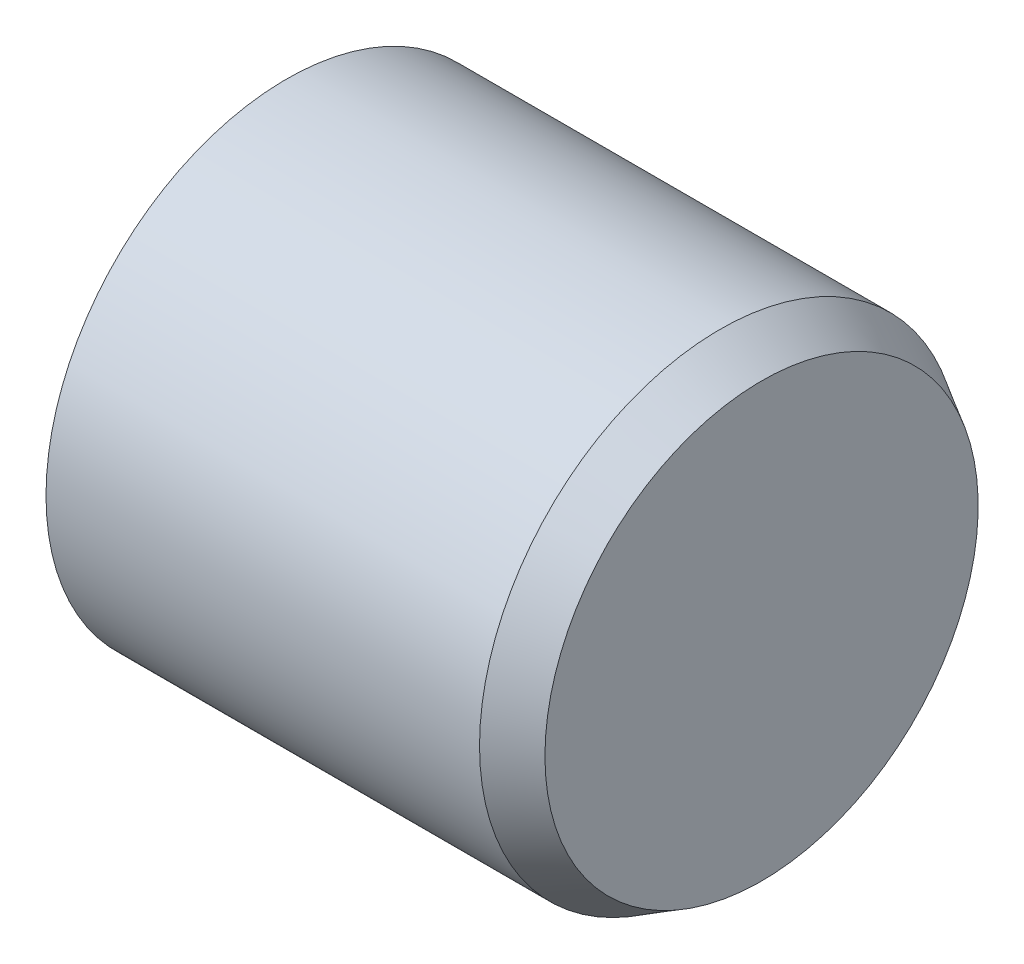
from build123d import *


with BuildPart() as part:
    # Sketch 1 → Revolve 2 (revolve)
    with BuildSketch(Plane.XY, mode=Mode.PRIVATE) as revolve_2_sk:
        Polygon((0, 0), (0, 3.9878), (7.186592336, 3.9878), (7.874, 3.590925), (7.874, 0), align=None)
    revolve(revolve_2_sk.sketch.rotate(Axis((-11.702387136, 0, 0), (1, 0, 0)), 90), axis=Axis((-11.702387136, 0, 0), (1, 0, 0)))


solid = part.part
